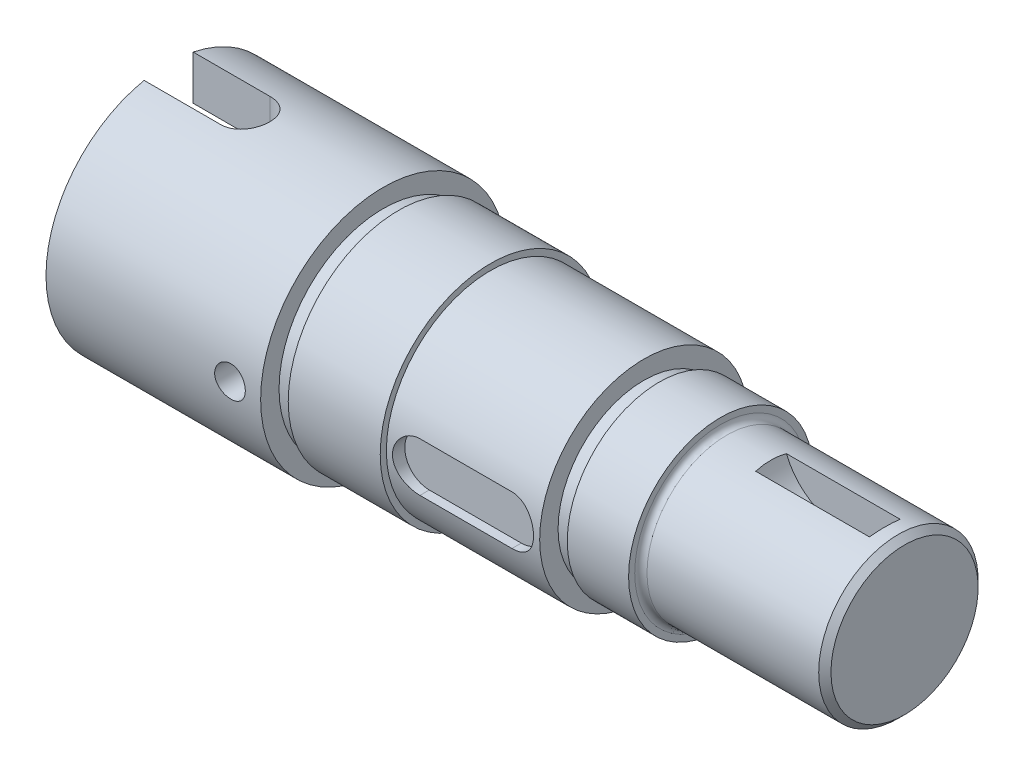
from build123d import *

# Parameters (mm, degrees)
SKETCH_3_R          = 5
CUT_EXTRUDE_1_DEPTH = 50
CUT_EXTRUDE_2_DEPTH = 100
CUT_EXTRUDE_3_DEPTH = 50
FILLET_1_R          = 2
CUT_EXTRUDE_4_DEPTH = 5


with BuildPart() as part:
    # Sketch 1 → Revolve 1 (revolve)
    with BuildSketch(Plane.XY, mode=Mode.PRIVATE) as revolve_1_sk:
        Polygon((-105, 0), (-105, 40), (-35, 40), (-35, 34), (-30, 34), (-30, 36), (0, 36), (0, 34), (50, 34), (50, 28), (55, 28), (55, 30), (75, 30), (75, 26), (133, 26), (135, 24), (135, 0), align=None)
    revolve(revolve_1_sk.sketch.rotate(Axis((-79.083045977, 0, 0), (1, 0, 0)), 90), axis=Axis((-79.083045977, 0, 0), (1, 0, 0)))

    # Sketch 3 → Cut-Extrude 1 (cut, symmetric)
    with BuildSketch(Plane.XY):
        with Locations((-45, 0)):
            Circle(SKETCH_3_R)
    extrude(amount=CUT_EXTRUDE_1_DEPTH, both=True, mode=Mode.SUBTRACT)

    # Sketch 4 → Cut-Extrude 2 (cut)
    with BuildSketch(Plane.XY.offset(30)):
        with BuildLine():
            Line((10, 8), (40, 8))
            ThreePointArc((40, 8), (48, 0), (40, -8))
            Line((40, -8), (10, -8))
            ThreePointArc((10, -8), (2, 0), (10, 8))
        make_face()
    extrude(amount=CUT_EXTRUDE_2_DEPTH, mode=Mode.SUBTRACT)

    # Sketch 5 → Cut-Revolve 2 (revolve, cut)
    with BuildSketch(Plane(origin=(0, 0, 0), x_dir=(1, 0, 0), z_dir=(0, 1, 0)), mode=Mode.PRIVATE) as cut_revolve_2_sk:
        Polygon((-105, 25.980762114), (-70, 25.980762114), (-55, 0), (-105, 0), align=None)
    revolve(cut_revolve_2_sk.sketch.rotate(Axis((0, 0, 0), (-1, 0, 0)), 180), axis=Axis((0, 0, 0), (-1, 0, 0)), mode=Mode.SUBTRACT)

    # Sketch 6 → Cut-Extrude 3 (cut, symmetric)
    with BuildSketch(Plane(origin=(0, 0, 0), x_dir=(1, 0, 0), z_dir=(0, 1, 0))):
        with BuildLine():
            Line((-105, 8), (-80, 8))
            ThreePointArc((-80, 8), (-72, 0), (-80, -8))
            Line((-80, -8), (-105, -8))
            Line((-105, -8), (-105, 8))
        make_face()
    extrude(amount=CUT_EXTRUDE_3_DEPTH, both=True, mode=Mode.SUBTRACT)

    # Fillet 1
    fillet_1_edges = [part.edges().sort_by_distance(p)[0] for p in [
        (75, 0, -26),
    ]]
    fillet(fillet_1_edges, radius=FILLET_1_R)

    # Sketch 2 → Cut-Extrude 4 (cut, symmetric)
    with BuildSketch(Plane.XY):
        with BuildLine():
            Line((90, 33), (130, 33))
            ThreePointArc((130, 33), (110, 13), (90, 33))
        make_face()
    extrude(amount=CUT_EXTRUDE_4_DEPTH, both=True, mode=Mode.SUBTRACT)


solid = part.part
